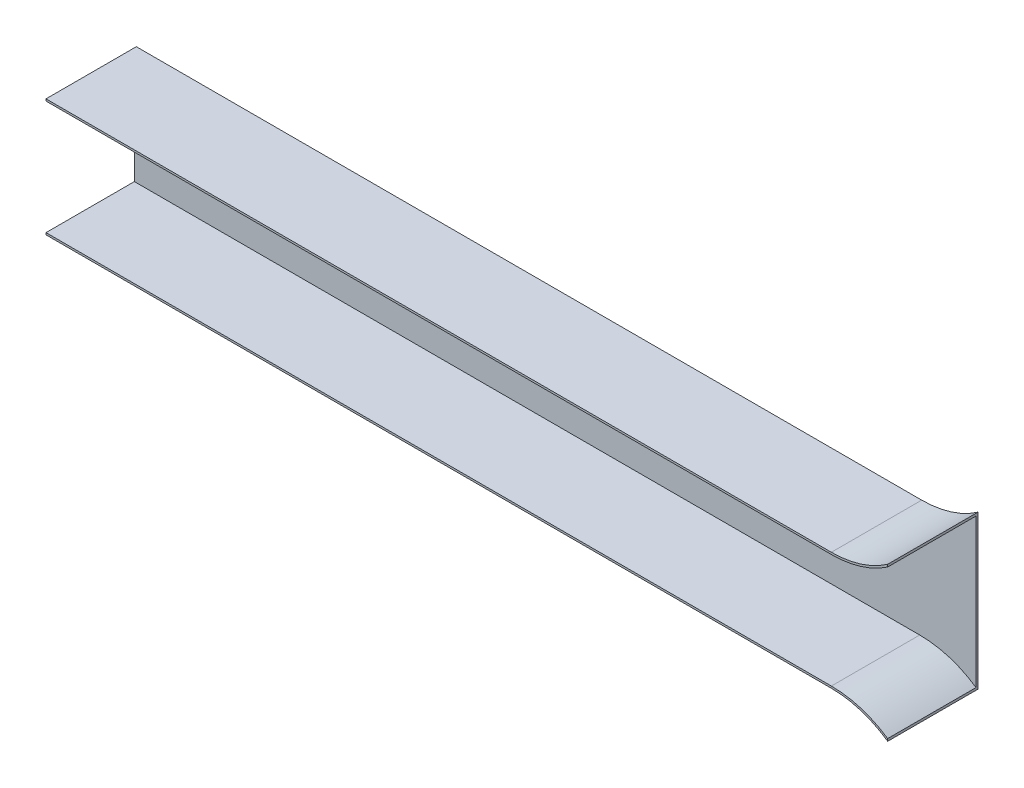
from build123d import *

# Parameters (mm, degrees)
BASE_EXTRUSION_DEPTH = 1
BOSS_EXTRU_1_DEPTH   = 45


with BuildPart() as part:
    # Esquisse3 → Base-Extrusion (new body)
    with BuildSketch(Plane.XY):
        with BuildLine():
            Line((400, -30), (0, -30))
            Line((0, -30), (0, 30))
            Line((0, 30), (400, 30))
            ThreePointArc((400, 30), (415.035289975, 32.314152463), (428.678821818, 39.042397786))
            Line((428.678821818, 39.042397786), (428.678821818, -39.042397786))
            ThreePointArc((428.678821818, -39.042397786), (415.035289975, -32.314152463), (400, -30))
        make_face()
    extrude(amount=BASE_EXTRUSION_DEPTH)

    # Esquisse4 → Boss.-Extru.1 (add)
    with BuildSketch(Plane.XY.offset(1)):
        with BuildLine():
            Line((400, 30), (0, 30))
            Line((0, 30), (0, 29))
            Line((0, 29), (400, 29))
            ThreePointArc((400, 29), (415.003319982, 31.25679135), (428.678821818, 37.827435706))
            Line((428.678821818, 37.827435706), (428.678821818, 39.042397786))
            ThreePointArc((428.678821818, 39.042397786), (415.035289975, 32.314152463), (400, 30))
        make_face()
        with BuildLine():
            Line((400, -29), (0, -29))
            Line((0, -29), (0, -30))
            Line((0, -30), (400, -30))
            ThreePointArc((400, -30), (415.035289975, -32.314152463), (428.678821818, -39.042397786))
            Line((428.678821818, -39.042397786), (428.678821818, -37.827435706))
            ThreePointArc((428.678821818, -37.827435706), (415.003319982, -31.25679135), (400, -29))
        make_face()
    extrude(amount=BOSS_EXTRU_1_DEPTH)


solid = part.part
